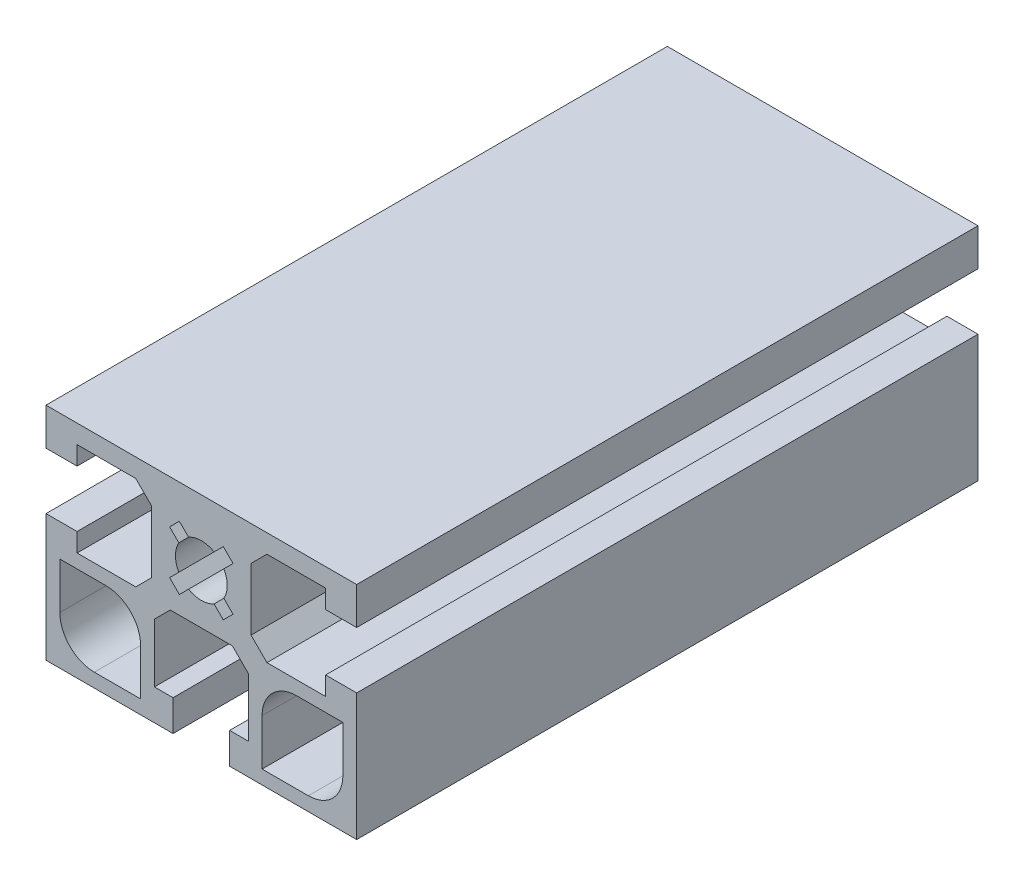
from build123d import *

# Parameters (mm, degrees)
EXTRUDE1_DEPTH           = 45
EXTRUDE1_DEPTH_BACK      = 45
F_7_0_7_DIAMETER_HOLE1_D = 7


with BuildPart() as part:
    # Sketch1 → Extrude1 (new, two sides: drawn at the far end of the back side and taken through both)
    with BuildSketch(Plane.XY.offset(-EXTRUDE1_DEPTH_BACK)):
        Polygon((-22.499999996, -22.499999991), (-4.099999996, -22.499999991), (-4.099999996, -17.999999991), (-6.799999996, -17.999999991), (-6.799999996, -9.499999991), (-4.499999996, -7.199999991), (4.500000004, -7.199999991), (6.800000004, -9.499999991), (6.800000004, -17.999999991), (4.100000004, -17.999999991), (4.100000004, -22.499999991), (22.499999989, -22.499999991), (22.499999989, -4.099999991), (17.999999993, -4.099999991), (17.999999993, -6.799999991), (9.499999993, -6.799999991), (7.199999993, -4.499999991), (7.199999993, 4.500000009), (9.499999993, 6.800000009), (17.999999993, 6.800000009), (17.999999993, 4.100000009), (22.499999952, 4.100000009), (22.499999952, 9.499999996), (-22.499999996, 9.499999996), (-22.499999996, 4.100000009), (-17.999999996, 4.100000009), (-17.999999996, 6.800000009), (-9.499999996, 6.800000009), (-7.199999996, 4.500000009), (-7.199999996, -4.499999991), (-9.499999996, -6.799999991), (-17.999999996, -6.799999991), (-17.999999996, -4.099999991), (-22.499999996, -4.099999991), align=None)
        with BuildLine():
            Line((-20.499997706, -15.500002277), (-20.499997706, -8.799997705))
            Line((-20.499997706, -8.799997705), (-13.799993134, -8.799997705))
            ThreePointArc((-13.799993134, -8.799997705), (-10.264459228, -10.264463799), (-8.799993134, -13.799997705))
            Line((-8.799993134, -13.799997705), (-8.799993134, -20.500002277))
            Line((-8.799993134, -20.500002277), (-15.499997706, -20.500002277))
            ThreePointArc((-15.499997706, -20.500002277), (-19.035531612, -19.035536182), (-20.499997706, -15.500002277))
        make_face(mode=Mode.SUBTRACT)
        with BuildLine():
            Line((8.799993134, -20.500002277), (8.799993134, -13.799997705))
            ThreePointArc((8.799993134, -13.799997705), (10.264459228, -10.264463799), (13.799993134, -8.799997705))
            Line((13.799993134, -8.799997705), (20.499997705, -8.799997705))
            Line((20.499997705, -8.799997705), (20.499997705, -15.500002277))
            ThreePointArc((20.499997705, -15.500002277), (19.035531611, -19.035536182), (15.499997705, -20.500002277))
            Line((15.499997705, -20.500002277), (8.799993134, -20.500002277))
        make_face(mode=Mode.SUBTRACT)
        with BuildLine():
            Line((-3.262737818, 1.848524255), (-4.596194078, 3.181980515))
            Line((-4.596194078, 3.181980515), (-3.181980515, 4.596194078))
            Line((-3.181980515, 4.596194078), (-1.848524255, 3.262737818))
            ThreePointArc((-1.848524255, 3.262737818), (0, 3.749999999), (1.848524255, 3.262737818))
            Line((1.848524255, 3.262737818), (3.181980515, 4.596194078))
            Line((3.181980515, 4.596194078), (4.596194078, 3.181980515))
            Line((4.596194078, 3.181980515), (3.262737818, 1.848524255))
            ThreePointArc((3.262737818, 1.848524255), (3.749999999, 0), (3.262737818, -1.848524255))
            Line((3.262737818, -1.848524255), (4.596194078, -3.181980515))
            Line((4.596194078, -3.181980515), (3.181980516, -4.596194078))
            Line((3.181980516, -4.596194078), (1.848524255, -3.262737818))
            ThreePointArc((1.848524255, -3.262737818), (0, -3.749999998), (-1.848524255, -3.262737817))
            Line((-1.848524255, -3.262737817), (-3.181980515, -4.596194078))
            Line((-3.181980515, -4.596194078), (-4.596194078, -3.181980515))
            Line((-4.596194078, -3.181980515), (-3.262737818, -1.848524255))
            ThreePointArc((-3.262737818, -1.848524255), (-3.749999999, 0), (-3.262737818, 1.848524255))
        make_face(mode=Mode.SUBTRACT)
    extrude(amount=EXTRUDE1_DEPTH + EXTRUDE1_DEPTH_BACK)

    # 7.0 _7_ Diameter Hole1 (through all)
    with Locations(Plane(origin=(-22.499999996, 0, -22.5), x_dir=(0, 0, -1), z_dir=(-1, 0, 0))):
        with Locations((0, 0), (-45, 0)):
            Hole(F_7_0_7_DIAMETER_HOLE1_D / 2)


solid = part.part
